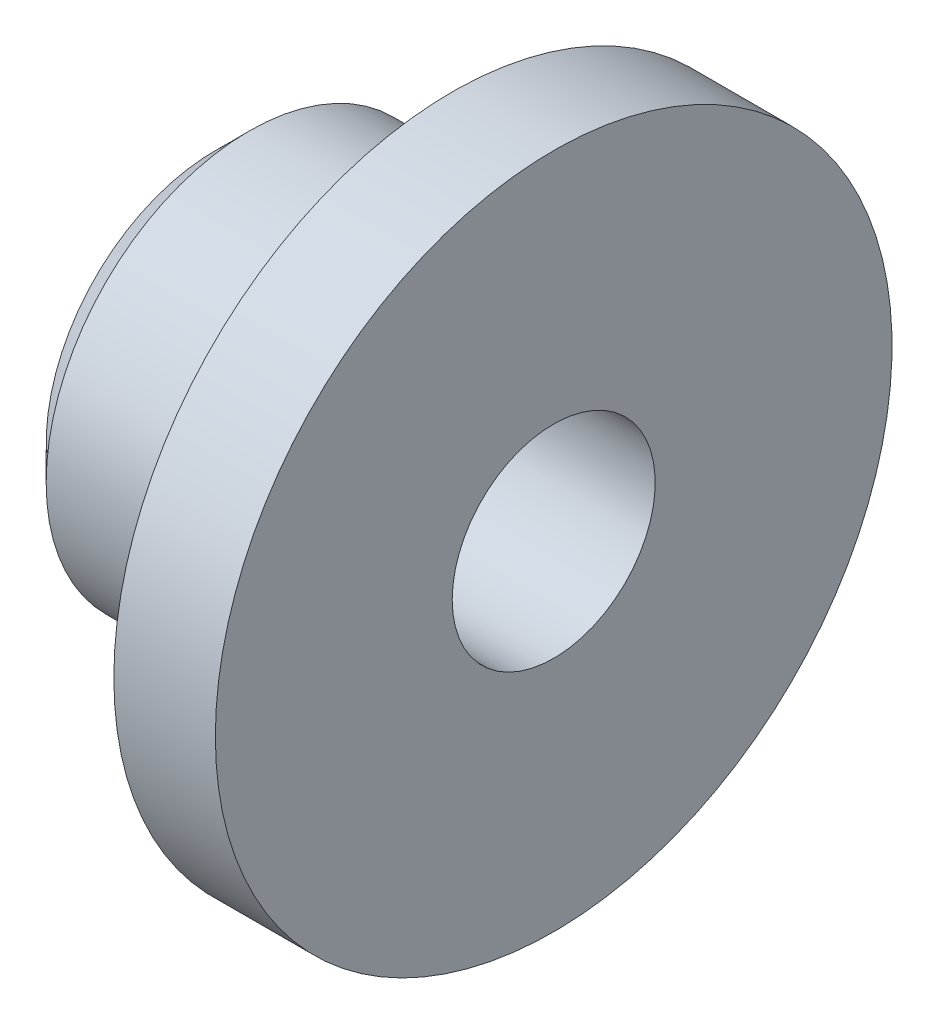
from build123d import *

# Parameters (mm, degrees)
CHANFREIN1_SIZE = 0.5


with BuildPart() as part:
    # Esquisse1 → R_volution1 (revolve)
    with BuildSketch(Plane(origin=(0, 0, -20.980989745), x_dir=(-1, 0, 0), z_dir=(0, 0, -1)), mode=Mode.PRIVATE) as r_volution1_sk:
        Polygon((176.591924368, 38.325618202), (176.591924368, 34.825618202), (178.091924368, 34.825618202), (178.091924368, 36.825618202), (181.591924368, 36.825618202), (181.591924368, 38.325618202), align=None)
    revolve(r_volution1_sk.sketch.rotate(Axis((-182.472480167, 39.825618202, -20.980989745), (1, 0, 0)), 270), axis=Axis((-182.472480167, 39.825618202, -20.980989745), (1, 0, 0)))

    # Chanfrein1
    chanfrein1_edges = [part.edges().sort_by_distance(p)[0] for p in [
        (-181.591924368, 39.825618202, -23.980989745),
    ]]
    chamfer(chanfrein1_edges, length=CHANFREIN1_SIZE)


solid = part.part
